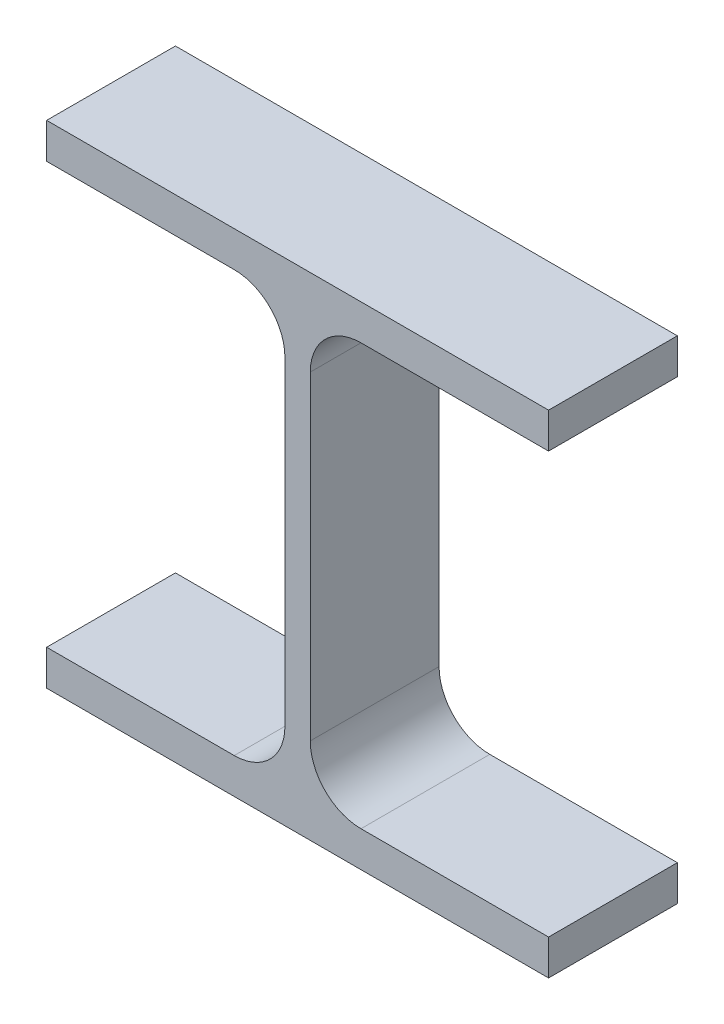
ISO-10303-21;
HEADER;
FILE_DESCRIPTION(('STEP AP214'),'2;1');
FILE_NAME('part.step','',(''),(''),'','','');
FILE_SCHEMA(('AUTOMOTIVE_DESIGN { 1 0 10303 214 1 1 1 1 }'));
ENDSEC;
DATA;
#1=APPLICATION_CONTEXT('core data for automotive mechanical design processes');
#2=APPLICATION_PROTOCOL_DEFINITION('international standard','automotive_design',2000,#1);
#3=PRODUCT_CONTEXT('',#1,'mechanical');
#4=PRODUCT('Part','Part','',(#3));
#5=PRODUCT_RELATED_PRODUCT_CATEGORY('part','',(#4));
#6=PRODUCT_DEFINITION_FORMATION('','',#4);
#7=PRODUCT_DEFINITION_CONTEXT('part definition',#1,'design');
#8=PRODUCT_DEFINITION('design','',#6,#7);
#9=PRODUCT_DEFINITION_SHAPE('','',#8);
#10=(LENGTH_UNIT() NAMED_UNIT(*) SI_UNIT(.MILLI.,.METRE.));
#11=(NAMED_UNIT(*) PLANE_ANGLE_UNIT() SI_UNIT($,.RADIAN.));
#12=(NAMED_UNIT(*) SI_UNIT($,.STERADIAN.) SOLID_ANGLE_UNIT());
#13=UNCERTAINTY_MEASURE_WITH_UNIT(LENGTH_MEASURE(1.E-05),#10,'distance_accuracy_value','');
#14=(GEOMETRIC_REPRESENTATION_CONTEXT(3) GLOBAL_UNCERTAINTY_ASSIGNED_CONTEXT((#13)) GLOBAL_UNIT_ASSIGNED_CONTEXT((#10,
#11,#12)) REPRESENTATION_CONTEXT('',''));
#15=CARTESIAN_POINT('',(0.,0.,0.));
#16=DIRECTION('',(0.,0.,1.));
#17=DIRECTION('',(1.,0.,0.));
#18=AXIS2_PLACEMENT_3D('',#15,#16,#17);
#19=CARTESIAN_POINT('',(-49.5,48.5,12.7));
#20=DIRECTION('',(1.,0.,0.));
#21=DIRECTION('',(0.,0.,-1.));
#22=AXIS2_PLACEMENT_3D('',#19,#20,#21);
#23=PLANE('',#22);
#24=DIRECTION('',(0.,-1.,0.));
#25=VECTOR('',#24,1.);
#26=CARTESIAN_POINT('',(-49.5,48.5,-12.7));
#27=LINE('',#26,#25);
#28=CARTESIAN_POINT('',(-49.5,48.5,-12.7));
#29=VERTEX_POINT('',#28);
#30=CARTESIAN_POINT('',(-49.5,41.5,-12.7));
#31=VERTEX_POINT('',#30);
#32=EDGE_CURVE('E176',#29,#31,#27,.T.);
#33=ORIENTED_EDGE('',*,*,#32,.T.);
#34=DIRECTION('',(0.,0.,-1.));
#35=VECTOR('',#34,1.);
#36=CARTESIAN_POINT('',(-49.5,41.5,12.7));
#37=LINE('',#36,#35);
#38=CARTESIAN_POINT('',(-49.5,41.5,12.7));
#39=VERTEX_POINT('',#38);
#40=EDGE_CURVE('E11',#39,#31,#37,.T.);
#41=ORIENTED_EDGE('',*,*,#40,.F.);
#42=DIRECTION('',(0.,-1.,0.));
#43=VECTOR('',#42,1.);
#44=CARTESIAN_POINT('',(-49.5,48.5,12.7));
#45=LINE('',#44,#43);
#46=CARTESIAN_POINT('',(-49.5,48.5,12.7));
#47=VERTEX_POINT('',#46);
#48=EDGE_CURVE('E206',#47,#39,#45,.T.);
#49=ORIENTED_EDGE('',*,*,#48,.F.);
#50=DIRECTION('',(0.,0.,-1.));
#51=VECTOR('',#50,1.);
#52=CARTESIAN_POINT('',(-49.5,48.5,12.7));
#53=LINE('',#52,#51);
#54=EDGE_CURVE('E172',#47,#29,#53,.T.);
#55=ORIENTED_EDGE('',*,*,#54,.T.);
#56=EDGE_LOOP('',(#33,#41,#49,#55));
#57=FACE_BOUND('',#56,.T.);
#58=ADVANCED_FACE('F32',(#57),#23,.F.);
#59=CARTESIAN_POINT('',(-49.5,41.5,12.7));
#60=DIRECTION('',(0.,1.,0.));
#61=DIRECTION('',(-1.,0.,0.));
#62=AXIS2_PLACEMENT_3D('',#59,#60,#61);
#63=PLANE('',#62);
#64=DIRECTION('',(1.,0.,0.));
#65=VECTOR('',#64,1.);
#66=CARTESIAN_POINT('',(-49.5,41.5,-12.7));
#67=LINE('',#66,#65);
#68=CARTESIAN_POINT('',(-12.5,41.5,-12.7));
#69=VERTEX_POINT('',#68);
#70=EDGE_CURVE('E179',#31,#69,#67,.T.);
#71=ORIENTED_EDGE('',*,*,#70,.T.);
#72=DIRECTION('',(0.,0.,-1.));
#73=VECTOR('',#72,1.);
#74=CARTESIAN_POINT('',(-12.5,41.5,12.7));
#75=LINE('',#74,#73);
#76=CARTESIAN_POINT('',(-12.5,41.5,12.7));
#77=VERTEX_POINT('',#76);
#78=EDGE_CURVE('E40',#77,#69,#75,.T.);
#79=ORIENTED_EDGE('',*,*,#78,.F.);
#80=DIRECTION('',(1.,0.,0.));
#81=VECTOR('',#80,1.);
#82=CARTESIAN_POINT('',(-49.5,41.5,12.7));
#83=LINE('',#82,#81);
#84=EDGE_CURVE('E115',#39,#77,#83,.T.);
#85=ORIENTED_EDGE('',*,*,#84,.F.);
#86=ORIENTED_EDGE('',*,*,#40,.T.);
#87=EDGE_LOOP('',(#71,#79,#85,#86));
#88=FACE_BOUND('',#87,.T.);
#89=ADVANCED_FACE('F304',(#88),#63,.F.);
#90=CARTESIAN_POINT('',(-12.5,31.5,12.7));
#91=DIRECTION('',(0.,0.,-1.));
#92=DIRECTION('',(-1.,0.,0.));
#93=AXIS2_PLACEMENT_3D('',#90,#91,#92);
#94=CYLINDRICAL_SURFACE('',#93,10.);
#95=CARTESIAN_POINT('',(-12.5,31.5,-12.7));
#96=DIRECTION('',(0.,0.,-1.));
#97=DIRECTION('',(-1.,0.,0.));
#98=AXIS2_PLACEMENT_3D('',#95,#96,#97);
#99=CIRCLE('',#98,10.);
#100=CARTESIAN_POINT('',(-2.49999999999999,31.5,-12.7));
#101=VERTEX_POINT('',#100);
#102=EDGE_CURVE('E181',#69,#101,#99,.T.);
#103=ORIENTED_EDGE('',*,*,#102,.T.);
#104=DIRECTION('',(0.,0.,-1.));
#105=VECTOR('',#104,1.);
#106=CARTESIAN_POINT('',(-2.49999999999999,31.5,12.7));
#107=LINE('',#106,#105);
#108=CARTESIAN_POINT('',(-2.49999999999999,31.5,12.7));
#109=VERTEX_POINT('',#108);
#110=EDGE_CURVE('E237',#109,#101,#107,.T.);
#111=ORIENTED_EDGE('',*,*,#110,.F.);
#112=CARTESIAN_POINT('',(-12.5,31.5,12.7));
#113=DIRECTION('',(0.,0.,-1.));
#114=DIRECTION('',(-1.,0.,0.));
#115=AXIS2_PLACEMENT_3D('',#112,#113,#114);
#116=CIRCLE('',#115,10.);
#117=EDGE_CURVE('E245',#77,#109,#116,.T.);
#118=ORIENTED_EDGE('',*,*,#117,.F.);
#119=ORIENTED_EDGE('',*,*,#78,.T.);
#120=EDGE_LOOP('',(#103,#111,#118,#119));
#121=FACE_BOUND('',#120,.T.);
#122=ADVANCED_FACE('F243',(#121),#94,.F.);
#123=CARTESIAN_POINT('',(-2.49999999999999,31.5,12.7));
#124=DIRECTION('',(1.,0.,0.));
#125=DIRECTION('',(0.,0.,-1.));
#126=AXIS2_PLACEMENT_3D('',#123,#124,#125);
#127=PLANE('',#126);
#128=DIRECTION('',(0.,-1.,0.));
#129=VECTOR('',#128,1.);
#130=CARTESIAN_POINT('',(-2.49999999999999,31.5,-12.7));
#131=LINE('',#130,#129);
#132=CARTESIAN_POINT('',(-2.49999999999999,-31.5,-12.7));
#133=VERTEX_POINT('',#132);
#134=EDGE_CURVE('E183',#101,#133,#131,.T.);
#135=ORIENTED_EDGE('',*,*,#134,.T.);
#136=DIRECTION('',(0.,0.,-1.));
#137=VECTOR('',#136,1.);
#138=CARTESIAN_POINT('',(-2.49999999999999,-31.5,12.7));
#139=LINE('',#138,#137);
#140=CARTESIAN_POINT('',(-2.49999999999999,-31.5,12.7));
#141=VERTEX_POINT('',#140);
#142=EDGE_CURVE('E234',#141,#133,#139,.T.);
#143=ORIENTED_EDGE('',*,*,#142,.F.);
#144=DIRECTION('',(0.,-1.,0.));
#145=VECTOR('',#144,1.);
#146=CARTESIAN_POINT('',(-2.49999999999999,31.5,12.7));
#147=LINE('',#146,#145);
#148=EDGE_CURVE('E263',#109,#141,#147,.T.);
#149=ORIENTED_EDGE('',*,*,#148,.F.);
#150=ORIENTED_EDGE('',*,*,#110,.T.);
#151=EDGE_LOOP('',(#135,#143,#149,#150));
#152=FACE_BOUND('',#151,.T.);
#153=ADVANCED_FACE('F254',(#152),#127,.F.);
#154=CARTESIAN_POINT('',(-12.5,-31.5,12.7));
#155=DIRECTION('',(0.,0.,-1.));
#156=DIRECTION('',(-1.,0.,0.));
#157=AXIS2_PLACEMENT_3D('',#154,#155,#156);
#158=CYLINDRICAL_SURFACE('',#157,10.);
#159=CARTESIAN_POINT('',(-12.5,-31.5,-12.7));
#160=DIRECTION('',(0.,0.,-1.));
#161=DIRECTION('',(1.,0.,0.));
#162=AXIS2_PLACEMENT_3D('',#159,#160,#161);
#163=CIRCLE('',#162,10.);
#164=CARTESIAN_POINT('',(-12.5,-41.5,-12.7));
#165=VERTEX_POINT('',#164);
#166=EDGE_CURVE('E185',#133,#165,#163,.T.);
#167=ORIENTED_EDGE('',*,*,#166,.T.);
#168=DIRECTION('',(0.,0.,-1.));
#169=VECTOR('',#168,1.);
#170=CARTESIAN_POINT('',(-12.5,-41.5,12.7));
#171=LINE('',#170,#169);
#172=CARTESIAN_POINT('',(-12.5,-41.5,12.7));
#173=VERTEX_POINT('',#172);
#174=EDGE_CURVE('E231',#173,#165,#171,.T.);
#175=ORIENTED_EDGE('',*,*,#174,.F.);
#176=CARTESIAN_POINT('',(-12.5,-31.5,12.7));
#177=DIRECTION('',(0.,0.,-1.));
#178=DIRECTION('',(1.,0.,0.));
#179=AXIS2_PLACEMENT_3D('',#176,#177,#178);
#180=CIRCLE('',#179,10.);
#181=EDGE_CURVE('E260',#141,#173,#180,.T.);
#182=ORIENTED_EDGE('',*,*,#181,.F.);
#183=ORIENTED_EDGE('',*,*,#142,.T.);
#184=EDGE_LOOP('',(#167,#175,#182,#183));
#185=FACE_BOUND('',#184,.T.);
#186=ADVANCED_FACE('F258',(#185),#158,.F.);
#187=CARTESIAN_POINT('',(-49.5,-41.5,12.7));
#188=DIRECTION('',(0.,-1.,0.));
#189=DIRECTION('',(1.,0.,0.));
#190=AXIS2_PLACEMENT_3D('',#187,#188,#189);
#191=PLANE('',#190);
#192=DIRECTION('',(-1.,0.,0.));
#193=VECTOR('',#192,1.);
#194=CARTESIAN_POINT('',(-49.5,-41.5,-12.7));
#195=LINE('',#194,#193);
#196=CARTESIAN_POINT('',(-49.5,-41.5,-12.7));
#197=VERTEX_POINT('',#196);
#198=EDGE_CURVE('E187',#165,#197,#195,.T.);
#199=ORIENTED_EDGE('',*,*,#198,.T.);
#200=DIRECTION('',(0.,0.,-1.));
#201=VECTOR('',#200,1.);
#202=CARTESIAN_POINT('',(-49.5,-41.5,12.7));
#203=LINE('',#202,#201);
#204=CARTESIAN_POINT('',(-49.5,-41.5,12.7));
#205=VERTEX_POINT('',#204);
#206=EDGE_CURVE('E228',#205,#197,#203,.T.);
#207=ORIENTED_EDGE('',*,*,#206,.F.);
#208=DIRECTION('',(-1.,0.,0.));
#209=VECTOR('',#208,1.);
#210=CARTESIAN_POINT('',(-49.5,-41.5,12.7));
#211=LINE('',#210,#209);
#212=EDGE_CURVE('E262',#173,#205,#211,.T.);
#213=ORIENTED_EDGE('',*,*,#212,.F.);
#214=ORIENTED_EDGE('',*,*,#174,.T.);
#215=EDGE_LOOP('',(#199,#207,#213,#214));
#216=FACE_BOUND('',#215,.T.);
#217=ADVANCED_FACE('F317',(#216),#191,.F.);
#218=CARTESIAN_POINT('',(-49.5,-41.5,12.7));
#219=DIRECTION('',(1.,0.,0.));
#220=DIRECTION('',(0.,0.,-1.));
#221=AXIS2_PLACEMENT_3D('',#218,#219,#220);
#222=PLANE('',#221);
#223=DIRECTION('',(0.,-1.,0.));
#224=VECTOR('',#223,1.);
#225=CARTESIAN_POINT('',(-49.5,-41.5,-12.7));
#226=LINE('',#225,#224);
#227=CARTESIAN_POINT('',(-49.5,-48.5,-12.7));
#228=VERTEX_POINT('',#227);
#229=EDGE_CURVE('E189',#197,#228,#226,.T.);
#230=ORIENTED_EDGE('',*,*,#229,.T.);
#231=DIRECTION('',(0.,0.,-1.));
#232=VECTOR('',#231,1.);
#233=CARTESIAN_POINT('',(-49.5,-48.5,12.7));
#234=LINE('',#233,#232);
#235=CARTESIAN_POINT('',(-49.5,-48.5,12.7));
#236=VERTEX_POINT('',#235);
#237=EDGE_CURVE('E225',#236,#228,#234,.T.);
#238=ORIENTED_EDGE('',*,*,#237,.F.);
#239=DIRECTION('',(0.,-1.,0.));
#240=VECTOR('',#239,1.);
#241=CARTESIAN_POINT('',(-49.5,-41.5,12.7));
#242=LINE('',#241,#240);
#243=EDGE_CURVE('E265',#205,#236,#242,.T.);
#244=ORIENTED_EDGE('',*,*,#243,.F.);
#245=ORIENTED_EDGE('',*,*,#206,.T.);
#246=EDGE_LOOP('',(#230,#238,#244,#245));
#247=FACE_BOUND('',#246,.T.);
#248=ADVANCED_FACE('F320',(#247),#222,.F.);
#249=CARTESIAN_POINT('',(-49.5,-48.5,12.7));
#250=DIRECTION('',(0.,1.,0.));
#251=DIRECTION('',(0.,0.,1.));
#252=AXIS2_PLACEMENT_3D('',#249,#250,#251);
#253=PLANE('',#252);
#254=DIRECTION('',(1.,0.,0.));
#255=VECTOR('',#254,1.);
#256=CARTESIAN_POINT('',(-49.5,-48.5,-12.7));
#257=LINE('',#256,#255);
#258=CARTESIAN_POINT('',(49.5,-48.5,-12.7));
#259=VERTEX_POINT('',#258);
#260=EDGE_CURVE('E191',#228,#259,#257,.T.);
#261=ORIENTED_EDGE('',*,*,#260,.T.);
#262=DIRECTION('',(0.,0.,-1.));
#263=VECTOR('',#262,1.);
#264=CARTESIAN_POINT('',(49.5,-48.5,12.7));
#265=LINE('',#264,#263);
#266=CARTESIAN_POINT('',(49.5,-48.5,12.7));
#267=VERTEX_POINT('',#266);
#268=EDGE_CURVE('E222',#267,#259,#265,.T.);
#269=ORIENTED_EDGE('',*,*,#268,.F.);
#270=DIRECTION('',(1.,0.,0.));
#271=VECTOR('',#270,1.);
#272=CARTESIAN_POINT('',(-49.5,-48.5,12.7));
#273=LINE('',#272,#271);
#274=EDGE_CURVE('E271',#236,#267,#273,.T.);
#275=ORIENTED_EDGE('',*,*,#274,.F.);
#276=ORIENTED_EDGE('',*,*,#237,.T.);
#277=EDGE_LOOP('',(#261,#269,#275,#276));
#278=FACE_BOUND('',#277,.T.);
#279=ADVANCED_FACE('F324',(#278),#253,.F.);
#280=CARTESIAN_POINT('',(49.5,-41.5,12.7));
#281=DIRECTION('',(-1.,0.,0.));
#282=DIRECTION('',(0.,0.,1.));
#283=AXIS2_PLACEMENT_3D('',#280,#281,#282);
#284=PLANE('',#283);
#285=DIRECTION('',(0.,1.,0.));
#286=VECTOR('',#285,1.);
#287=CARTESIAN_POINT('',(49.5,-41.5,-12.7));
#288=LINE('',#287,#286);
#289=CARTESIAN_POINT('',(49.5,-41.5,-12.7));
#290=VERTEX_POINT('',#289);
#291=EDGE_CURVE('E193',#259,#290,#288,.T.);
#292=ORIENTED_EDGE('',*,*,#291,.T.);
#293=DIRECTION('',(0.,0.,-1.));
#294=VECTOR('',#293,1.);
#295=CARTESIAN_POINT('',(49.5,-41.5,12.7));
#296=LINE('',#295,#294);
#297=CARTESIAN_POINT('',(49.5,-41.5,12.7));
#298=VERTEX_POINT('',#297);
#299=EDGE_CURVE('E219',#298,#290,#296,.T.);
#300=ORIENTED_EDGE('',*,*,#299,.F.);
#301=DIRECTION('',(0.,1.,0.));
#302=VECTOR('',#301,1.);
#303=CARTESIAN_POINT('',(49.5,-41.5,12.7));
#304=LINE('',#303,#302);
#305=EDGE_CURVE('E273',#267,#298,#304,.T.);
#306=ORIENTED_EDGE('',*,*,#305,.F.);
#307=ORIENTED_EDGE('',*,*,#268,.T.);
#308=EDGE_LOOP('',(#292,#300,#306,#307));
#309=FACE_BOUND('',#308,.T.);
#310=ADVANCED_FACE('F328',(#309),#284,.F.);
#311=CARTESIAN_POINT('',(49.5,-41.5,12.7));
#312=DIRECTION('',(0.,-1.,0.));
#313=DIRECTION('',(1.,0.,0.));
#314=AXIS2_PLACEMENT_3D('',#311,#312,#313);
#315=PLANE('',#314);
#316=DIRECTION('',(-1.,0.,0.));
#317=VECTOR('',#316,1.);
#318=CARTESIAN_POINT('',(49.5,-41.5,-12.7));
#319=LINE('',#318,#317);
#320=CARTESIAN_POINT('',(12.5,-41.5,-12.7));
#321=VERTEX_POINT('',#320);
#322=EDGE_CURVE('E195',#290,#321,#319,.T.);
#323=ORIENTED_EDGE('',*,*,#322,.T.);
#324=DIRECTION('',(0.,0.,-1.));
#325=VECTOR('',#324,1.);
#326=CARTESIAN_POINT('',(12.5,-41.5,12.7));
#327=LINE('',#326,#325);
#328=CARTESIAN_POINT('',(12.5,-41.5,12.7));
#329=VERTEX_POINT('',#328);
#330=EDGE_CURVE('E216',#329,#321,#327,.T.);
#331=ORIENTED_EDGE('',*,*,#330,.F.);
#332=DIRECTION('',(-1.,0.,0.));
#333=VECTOR('',#332,1.);
#334=CARTESIAN_POINT('',(49.5,-41.5,12.7));
#335=LINE('',#334,#333);
#336=EDGE_CURVE('E275',#298,#329,#335,.T.);
#337=ORIENTED_EDGE('',*,*,#336,.F.);
#338=ORIENTED_EDGE('',*,*,#299,.T.);
#339=EDGE_LOOP('',(#323,#331,#337,#338));
#340=FACE_BOUND('',#339,.T.);
#341=ADVANCED_FACE('F332',(#340),#315,.F.);
#342=CARTESIAN_POINT('',(12.5,-31.5,12.7));
#343=DIRECTION('',(0.,0.,-1.));
#344=DIRECTION('',(-1.,0.,0.));
#345=AXIS2_PLACEMENT_3D('',#342,#343,#344);
#346=CYLINDRICAL_SURFACE('',#345,10.);
#347=CARTESIAN_POINT('',(12.5,-31.5,-12.7));
#348=DIRECTION('',(0.,0.,-1.));
#349=DIRECTION('',(-1.,0.,0.));
#350=AXIS2_PLACEMENT_3D('',#347,#348,#349);
#351=CIRCLE('',#350,10.);
#352=CARTESIAN_POINT('',(2.49999999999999,-31.5,-12.7));
#353=VERTEX_POINT('',#352);
#354=EDGE_CURVE('E197',#321,#353,#351,.T.);
#355=ORIENTED_EDGE('',*,*,#354,.T.);
#356=DIRECTION('',(0.,0.,-1.));
#357=VECTOR('',#356,1.);
#358=CARTESIAN_POINT('',(2.49999999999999,-31.5,12.7));
#359=LINE('',#358,#357);
#360=CARTESIAN_POINT('',(2.49999999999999,-31.5,12.7));
#361=VERTEX_POINT('',#360);
#362=EDGE_CURVE('E213',#361,#353,#359,.T.);
#363=ORIENTED_EDGE('',*,*,#362,.F.);
#364=CARTESIAN_POINT('',(12.5,-31.5,12.7));
#365=DIRECTION('',(0.,0.,-1.));
#366=DIRECTION('',(-1.,0.,0.));
#367=AXIS2_PLACEMENT_3D('',#364,#365,#366);
#368=CIRCLE('',#367,10.);
#369=EDGE_CURVE('E277',#329,#361,#368,.T.);
#370=ORIENTED_EDGE('',*,*,#369,.F.);
#371=ORIENTED_EDGE('',*,*,#330,.T.);
#372=EDGE_LOOP('',(#355,#363,#370,#371));
#373=FACE_BOUND('',#372,.T.);
#374=ADVANCED_FACE('F336',(#373),#346,.F.);
#375=CARTESIAN_POINT('',(2.49999999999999,31.5,12.7));
#376=DIRECTION('',(-1.,0.,0.));
#377=DIRECTION('',(0.,0.,1.));
#378=AXIS2_PLACEMENT_3D('',#375,#376,#377);
#379=PLANE('',#378);
#380=DIRECTION('',(0.,1.,0.));
#381=VECTOR('',#380,1.);
#382=CARTESIAN_POINT('',(2.49999999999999,31.5,-12.7));
#383=LINE('',#382,#381);
#384=CARTESIAN_POINT('',(2.49999999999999,31.5,-12.7));
#385=VERTEX_POINT('',#384);
#386=EDGE_CURVE('E199',#353,#385,#383,.T.);
#387=ORIENTED_EDGE('',*,*,#386,.T.);
#388=DIRECTION('',(0.,0.,-1.));
#389=VECTOR('',#388,1.);
#390=CARTESIAN_POINT('',(2.49999999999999,31.5,12.7));
#391=LINE('',#390,#389);
#392=CARTESIAN_POINT('',(2.49999999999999,31.5,12.7));
#393=VERTEX_POINT('',#392);
#394=EDGE_CURVE('E210',#393,#385,#391,.T.);
#395=ORIENTED_EDGE('',*,*,#394,.F.);
#396=DIRECTION('',(0.,1.,0.));
#397=VECTOR('',#396,1.);
#398=CARTESIAN_POINT('',(2.49999999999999,31.5,12.7));
#399=LINE('',#398,#397);
#400=EDGE_CURVE('E279',#361,#393,#399,.T.);
#401=ORIENTED_EDGE('',*,*,#400,.F.);
#402=ORIENTED_EDGE('',*,*,#362,.T.);
#403=EDGE_LOOP('',(#387,#395,#401,#402));
#404=FACE_BOUND('',#403,.T.);
#405=ADVANCED_FACE('F285',(#404),#379,.F.);
#406=CARTESIAN_POINT('',(12.5,31.5,12.7));
#407=DIRECTION('',(0.,0.,-1.));
#408=DIRECTION('',(-1.,0.,0.));
#409=AXIS2_PLACEMENT_3D('',#406,#407,#408);
#410=CYLINDRICAL_SURFACE('',#409,10.);
#411=CARTESIAN_POINT('',(12.5,31.5,-12.7));
#412=DIRECTION('',(0.,0.,-1.));
#413=DIRECTION('',(1.,0.,0.));
#414=AXIS2_PLACEMENT_3D('',#411,#412,#413);
#415=CIRCLE('',#414,10.);
#416=CARTESIAN_POINT('',(12.5,41.5,-12.7));
#417=VERTEX_POINT('',#416);
#418=EDGE_CURVE('E201',#385,#417,#415,.T.);
#419=ORIENTED_EDGE('',*,*,#418,.T.);
#420=DIRECTION('',(0.,0.,-1.));
#421=VECTOR('',#420,1.);
#422=CARTESIAN_POINT('',(12.5,41.5,12.7));
#423=LINE('',#422,#421);
#424=CARTESIAN_POINT('',(12.5,41.5,12.7));
#425=VERTEX_POINT('',#424);
#426=EDGE_CURVE('E167',#425,#417,#423,.T.);
#427=ORIENTED_EDGE('',*,*,#426,.F.);
#428=CARTESIAN_POINT('',(12.5,31.5,12.7));
#429=DIRECTION('',(0.,0.,-1.));
#430=DIRECTION('',(1.,0.,0.));
#431=AXIS2_PLACEMENT_3D('',#428,#429,#430);
#432=CIRCLE('',#431,10.);
#433=EDGE_CURVE('E158',#393,#425,#432,.T.);
#434=ORIENTED_EDGE('',*,*,#433,.F.);
#435=ORIENTED_EDGE('',*,*,#394,.T.);
#436=EDGE_LOOP('',(#419,#427,#434,#435));
#437=FACE_BOUND('',#436,.T.);
#438=ADVANCED_FACE('F289',(#437),#410,.F.);
#439=CARTESIAN_POINT('',(49.5,41.5,12.7));
#440=DIRECTION('',(0.,1.,0.));
#441=DIRECTION('',(-1.,0.,0.));
#442=AXIS2_PLACEMENT_3D('',#439,#440,#441);
#443=PLANE('',#442);
#444=DIRECTION('',(1.,0.,0.));
#445=VECTOR('',#444,1.);
#446=CARTESIAN_POINT('',(49.5,41.5,-12.7));
#447=LINE('',#446,#445);
#448=CARTESIAN_POINT('',(49.5,41.5,-12.7));
#449=VERTEX_POINT('',#448);
#450=EDGE_CURVE('E166',#417,#449,#447,.T.);
#451=ORIENTED_EDGE('',*,*,#450,.T.);
#452=DIRECTION('',(0.,0.,-1.));
#453=VECTOR('',#452,1.);
#454=CARTESIAN_POINT('',(49.5,41.5,12.7));
#455=LINE('',#454,#453);
#456=CARTESIAN_POINT('',(49.5,41.5,12.7));
#457=VERTEX_POINT('',#456);
#458=EDGE_CURVE('E163',#457,#449,#455,.T.);
#459=ORIENTED_EDGE('',*,*,#458,.F.);
#460=DIRECTION('',(1.,0.,0.));
#461=VECTOR('',#460,1.);
#462=CARTESIAN_POINT('',(49.5,41.5,12.7));
#463=LINE('',#462,#461);
#464=EDGE_CURVE('E152',#425,#457,#463,.T.);
#465=ORIENTED_EDGE('',*,*,#464,.F.);
#466=ORIENTED_EDGE('',*,*,#426,.T.);
#467=EDGE_LOOP('',(#451,#459,#465,#466));
#468=FACE_BOUND('',#467,.T.);
#469=ADVANCED_FACE('F164',(#468),#443,.F.);
#470=CARTESIAN_POINT('',(49.5,48.5,12.7));
#471=DIRECTION('',(-1.,0.,0.));
#472=DIRECTION('',(0.,0.,1.));
#473=AXIS2_PLACEMENT_3D('',#470,#471,#472);
#474=PLANE('',#473);
#475=DIRECTION('',(0.,1.,0.));
#476=VECTOR('',#475,1.);
#477=CARTESIAN_POINT('',(49.5,48.5,-12.7));
#478=LINE('',#477,#476);
#479=CARTESIAN_POINT('',(49.5,48.5,-12.7));
#480=VERTEX_POINT('',#479);
#481=EDGE_CURVE('E101',#449,#480,#478,.T.);
#482=ORIENTED_EDGE('',*,*,#481,.T.);
#483=DIRECTION('',(0.,0.,-1.));
#484=VECTOR('',#483,1.);
#485=CARTESIAN_POINT('',(49.5,48.5,12.7));
#486=LINE('',#485,#484);
#487=CARTESIAN_POINT('',(49.5,48.5,12.7));
#488=VERTEX_POINT('',#487);
#489=EDGE_CURVE('E168',#488,#480,#486,.T.);
#490=ORIENTED_EDGE('',*,*,#489,.F.);
#491=DIRECTION('',(0.,1.,0.));
#492=VECTOR('',#491,1.);
#493=CARTESIAN_POINT('',(49.5,48.5,12.7));
#494=LINE('',#493,#492);
#495=EDGE_CURVE('E156',#457,#488,#494,.T.);
#496=ORIENTED_EDGE('',*,*,#495,.F.);
#497=ORIENTED_EDGE('',*,*,#458,.T.);
#498=EDGE_LOOP('',(#482,#490,#496,#497));
#499=FACE_BOUND('',#498,.T.);
#500=ADVANCED_FACE('F170',(#499),#474,.F.);
#501=CARTESIAN_POINT('',(-49.5,48.5,12.7));
#502=DIRECTION('',(0.,-1.,0.));
#503=DIRECTION('',(0.,0.,-1.));
#504=AXIS2_PLACEMENT_3D('',#501,#502,#503);
#505=PLANE('',#504);
#506=DIRECTION('',(-1.,0.,0.));
#507=VECTOR('',#506,1.);
#508=CARTESIAN_POINT('',(-49.5,48.5,-12.7));
#509=LINE('',#508,#507);
#510=EDGE_CURVE('E107',#480,#29,#509,.T.);
#511=ORIENTED_EDGE('',*,*,#510,.T.);
#512=ORIENTED_EDGE('',*,*,#54,.F.);
#513=DIRECTION('',(-1.,0.,0.));
#514=VECTOR('',#513,1.);
#515=CARTESIAN_POINT('',(-49.5,48.5,12.7));
#516=LINE('',#515,#514);
#517=EDGE_CURVE('E48',#488,#47,#516,.T.);
#518=ORIENTED_EDGE('',*,*,#517,.F.);
#519=ORIENTED_EDGE('',*,*,#489,.T.);
#520=EDGE_LOOP('',(#511,#512,#518,#519));
#521=FACE_BOUND('',#520,.T.);
#522=ADVANCED_FACE('F293',(#521),#505,.F.);
#523=CARTESIAN_POINT('',(-12.5,31.5,12.7));
#524=DIRECTION('',(0.,0.,-1.));
#525=DIRECTION('',(-1.,0.,0.));
#526=AXIS2_PLACEMENT_3D('',#523,#524,#525);
#527=PLANE('',#526);
#528=ORIENTED_EDGE('',*,*,#48,.T.);
#529=ORIENTED_EDGE('',*,*,#84,.T.);
#530=ORIENTED_EDGE('',*,*,#117,.T.);
#531=ORIENTED_EDGE('',*,*,#148,.T.);
#532=ORIENTED_EDGE('',*,*,#181,.T.);
#533=ORIENTED_EDGE('',*,*,#212,.T.);
#534=ORIENTED_EDGE('',*,*,#243,.T.);
#535=ORIENTED_EDGE('',*,*,#274,.T.);
#536=ORIENTED_EDGE('',*,*,#305,.T.);
#537=ORIENTED_EDGE('',*,*,#336,.T.);
#538=ORIENTED_EDGE('',*,*,#369,.T.);
#539=ORIENTED_EDGE('',*,*,#400,.T.);
#540=ORIENTED_EDGE('',*,*,#433,.T.);
#541=ORIENTED_EDGE('',*,*,#464,.T.);
#542=ORIENTED_EDGE('',*,*,#495,.T.);
#543=ORIENTED_EDGE('',*,*,#517,.T.);
#544=EDGE_LOOP('',(#528,#529,#530,#531,#532,#533,#534,#535,#536,#537,#538,#539,#540,#541,#542,#543));
#545=FACE_BOUND('',#544,.T.);
#546=ADVANCED_FACE('F154',(#545),#527,.F.);
#547=CARTESIAN_POINT('',(-12.5,31.5,-12.7));
#548=DIRECTION('',(0.,0.,-1.));
#549=DIRECTION('',(-1.,0.,0.));
#550=AXIS2_PLACEMENT_3D('',#547,#548,#549);
#551=PLANE('',#550);
#552=ORIENTED_EDGE('',*,*,#32,.F.);
#553=ORIENTED_EDGE('',*,*,#510,.F.);
#554=ORIENTED_EDGE('',*,*,#481,.F.);
#555=ORIENTED_EDGE('',*,*,#450,.F.);
#556=ORIENTED_EDGE('',*,*,#418,.F.);
#557=ORIENTED_EDGE('',*,*,#386,.F.);
#558=ORIENTED_EDGE('',*,*,#354,.F.);
#559=ORIENTED_EDGE('',*,*,#322,.F.);
#560=ORIENTED_EDGE('',*,*,#291,.F.);
#561=ORIENTED_EDGE('',*,*,#260,.F.);
#562=ORIENTED_EDGE('',*,*,#229,.F.);
#563=ORIENTED_EDGE('',*,*,#198,.F.);
#564=ORIENTED_EDGE('',*,*,#166,.F.);
#565=ORIENTED_EDGE('',*,*,#134,.F.);
#566=ORIENTED_EDGE('',*,*,#102,.F.);
#567=ORIENTED_EDGE('',*,*,#70,.F.);
#568=EDGE_LOOP('',(#552,#553,#554,#555,#556,#557,#558,#559,#560,#561,#562,#563,#564,#565,#566,#567));
#569=FACE_BOUND('',#568,.T.);
#570=ADVANCED_FACE('F249',(#569),#551,.T.);
#571=CLOSED_SHELL('',(#58,#89,#122,#153,#186,#217,#248,#279,#310,#341,#374,#405,#438,#469,#500,
#522,#546,#570));
#572=MANIFOLD_SOLID_BREP('B2',#571);
#573=ADVANCED_BREP_SHAPE_REPRESENTATION('',(#18,#572),#14);
#574=SHAPE_DEFINITION_REPRESENTATION(#9,#573);
ENDSEC;
END-ISO-10303-21;
